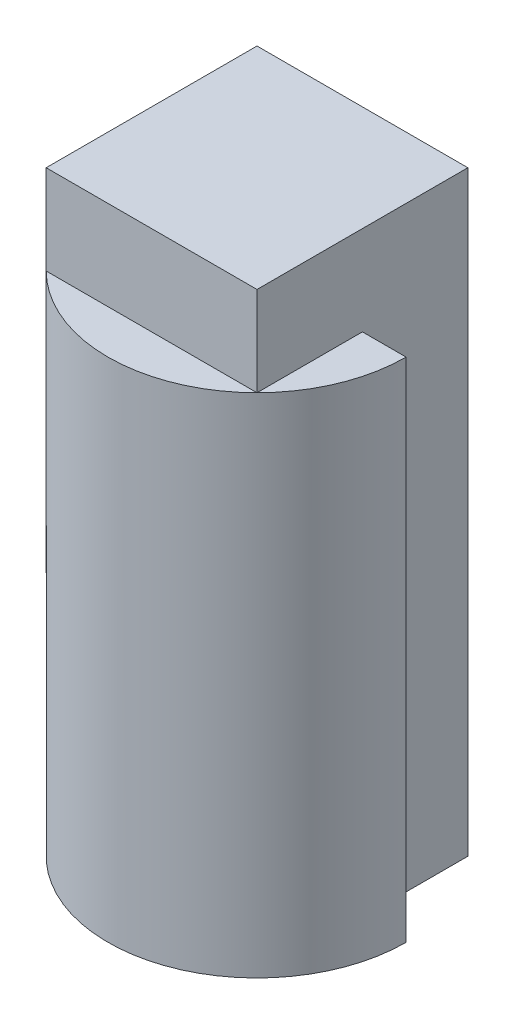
from build123d import *

# Parameters (mm, degrees)
SKIZZE1_R                       = 50
AUFSATZ_LINEAR_AUSTRAGEN1_DEPTH = 200
SKIZZE2_R                       = 4
AUFSATZ_LINEAR_AUSTRAGEN2_DEPTH = 10
SKIZZE3_R                       = 71.444618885
SKIZZE3_W                       = 70.710678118
SKIZZE3_H                       = 70.710678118
SCHNITT_LINEAR_AUSTRAGEN1_DEPTH = 30
SKIZZE4_W                       = 98.885209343
SKIZZE4_H                       = 35.355339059
SCHNITT_LINEAR_AUSTRAGEN2_DEPTH = 194.390796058


with BuildPart() as part:
    # Skizze1 → Aufsatz-Linear austragen1 (new body)
    with BuildSketch(Plane(origin=(0, 0, 0), x_dir=(1, 0, 0), z_dir=(0, 1, 0))):
        with Locations(Location((0, 0, 0), (0, 0, 270))):
            Circle(SKIZZE1_R)
    extrude(amount=AUFSATZ_LINEAR_AUSTRAGEN1_DEPTH)

    # Skizze2 → Aufsatz-Linear austragen2 (add)
    with BuildSketch(Plane.XZ):
        with Locations(Location((0, 0, 0), (0, 0, 90))):
            Circle(SKIZZE2_R)
    extrude(amount=AUFSATZ_LINEAR_AUSTRAGEN2_DEPTH)

    # Skizze3 → Schnitt-Linear austragen1 (cut)
    with BuildSketch(Plane(origin=(0, 200, 0), x_dir=(1, 0, 0), z_dir=(0, 1, 0))):
        Circle(SKIZZE3_R)
        Rectangle(SKIZZE3_W, SKIZZE3_H, mode=Mode.SUBTRACT)
    extrude(amount=-SCHNITT_LINEAR_AUSTRAGEN1_DEPTH, mode=Mode.SUBTRACT)

    # Skizze4 → Schnitt-Linear austragen2 (cut, through all)
    with BuildSketch(Plane(origin=(0, 170, 0), x_dir=(1, 0, 0), z_dir=(0, 1, 0))):
        with Locations((84.797943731, 17.67766953)):
            Rectangle(SKIZZE4_W, SKIZZE4_H)
    extrude(amount=-SCHNITT_LINEAR_AUSTRAGEN2_DEPTH, mode=Mode.SUBTRACT)


solid = part.part
